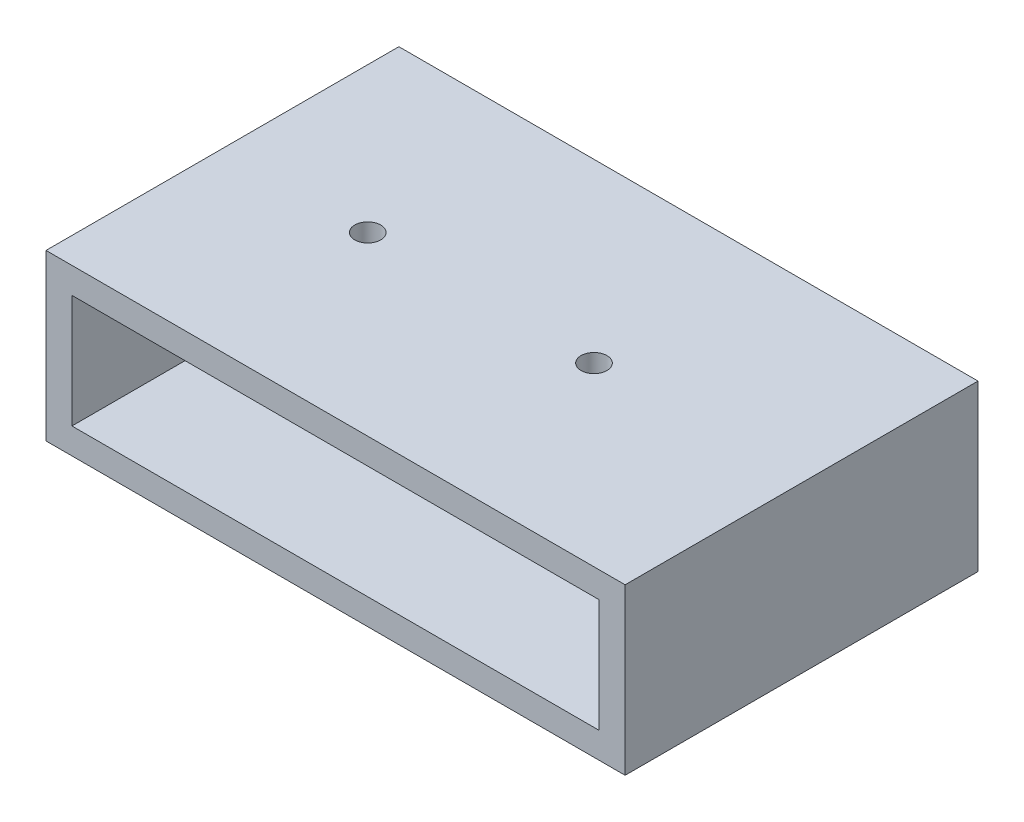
from build123d import *

# Parameters (mm, degrees)
SKETCH1_R           = 1.5875
BOSS_EXTRUDE1_DEPTH = 3.175
SKETCH2_W           = 3.175
SKETCH2_H           = 43.18
BOSS_EXTRUDE2_DEPTH = 17.018
SKETCH3_W           = 3.175
SKETCH3_H           = 43.18
BOSS_EXTRUDE3_DEPTH = 17.018
SKETCH4_W           = 70.866
SKETCH4_H           = 43.18
BOSS_EXTRUDE4_DEPTH = 17.018
SKETCH5_R           = 1.5875
CUT_EXTRUDE1_DEPTH  = 17.018
CUT_EXTRUDE2_DEPTH  = 48.006


with BuildPart() as part:
    # Sketch1 → Boss-Extrude1 (new body)
    with BuildSketch(Plane(origin=(0, 0, 0), x_dir=(1, 0, 0), z_dir=(0, 1, 0))):
        Polygon((53.086, 0), (53.086, 21.59), (-17.78, 21.59), (-17.78, 0), (-17.78, -21.59), (53.086, -21.59), align=None)
        with Locations(Location((0, 0, 0), (0, 0, 270))):
            Circle(SKETCH1_R, mode=Mode.SUBTRACT)
        with Locations(Location((27.686, 0, 0), (0, 0, 270))):
            Circle(SKETCH1_R, mode=Mode.SUBTRACT)
    extrude(amount=BOSS_EXTRUDE1_DEPTH)

    # Sketch2 → Boss-Extrude2 (add)
    with BuildSketch(Plane(origin=(0, 3.175, 0), x_dir=(1, 0, 0), z_dir=(0, 1, 0))):
        with Locations((-16.1925, 0)):
            Rectangle(SKETCH2_W, SKETCH2_H)
    extrude(amount=BOSS_EXTRUDE2_DEPTH)

    # Sketch3 → Boss-Extrude3 (add)
    with BuildSketch(Plane(origin=(0, 3.175, 0), x_dir=(1, 0, 0), z_dir=(0, 1, 0))):
        with Locations((51.4985, 0)):
            Rectangle(SKETCH3_W, SKETCH3_H)
    extrude(amount=BOSS_EXTRUDE3_DEPTH)

    # Sketch4 → Boss-Extrude4 (add)
    with BuildSketch(Plane(origin=(0, 3.175, 0), x_dir=(1, 0, 0), z_dir=(0, 1, 0))):
        with Locations((17.653, 0)):
            Rectangle(SKETCH4_W, SKETCH4_H)
    extrude(amount=BOSS_EXTRUDE4_DEPTH)

    # Sketch5 → Cut-Extrude1 (cut)
    with BuildSketch(Plane.XZ.offset(-3.175)):
        with Locations(Location((0, 0, 0), (0, 0, 270))):
            Circle(SKETCH5_R)
        with Locations(Location((27.686, 0, 0), (0, 0, 270))):
            Circle(SKETCH5_R)
    extrude(amount=-CUT_EXTRUDE1_DEPTH, mode=Mode.SUBTRACT)

    # Sketch6 → Cut-Extrude2 (cut)
    with BuildSketch(Plane.XY.offset(21.59)):
        Polygon((-14.605, 17.018), (-14.605, 3.175), (17.653, 3.175), (49.911, 3.175), (49.911, 17.018), (13.811589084, 17.018), align=None)
    extrude(amount=-CUT_EXTRUDE2_DEPTH, mode=Mode.SUBTRACT)


solid = part.part
